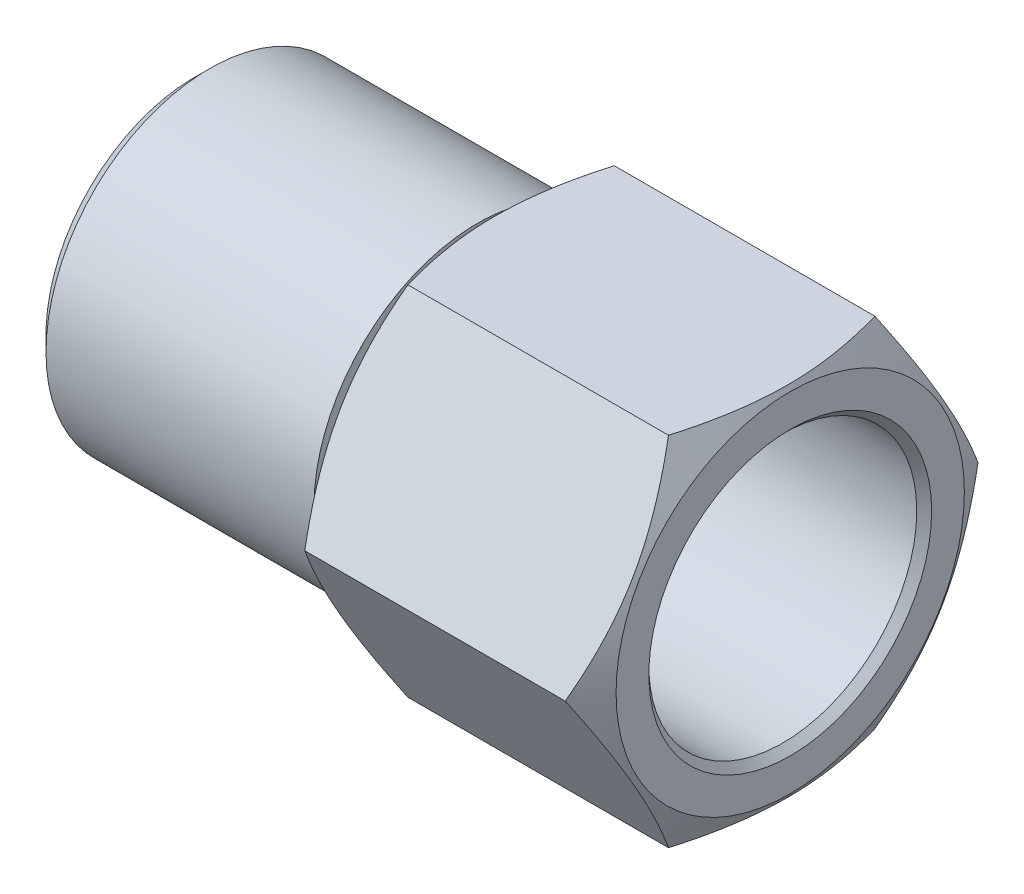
ISO-10303-21;
HEADER;
FILE_DESCRIPTION(('STEP AP214'),'2;1');
FILE_NAME('part.step','',(''),(''),'','','');
FILE_SCHEMA(('AUTOMOTIVE_DESIGN { 1 0 10303 214 1 1 1 1 }'));
ENDSEC;
DATA;
#1=APPLICATION_CONTEXT('core data for automotive mechanical design processes');
#2=APPLICATION_PROTOCOL_DEFINITION('international standard','automotive_design',2000,#1);
#3=PRODUCT_CONTEXT('',#1,'mechanical');
#4=PRODUCT('Part','Part','',(#3));
#5=PRODUCT_RELATED_PRODUCT_CATEGORY('part','',(#4));
#6=PRODUCT_DEFINITION_FORMATION('','',#4);
#7=PRODUCT_DEFINITION_CONTEXT('part definition',#1,'design');
#8=PRODUCT_DEFINITION('design','',#6,#7);
#9=PRODUCT_DEFINITION_SHAPE('','',#8);
#10=(LENGTH_UNIT() NAMED_UNIT(*) SI_UNIT(.MILLI.,.METRE.));
#11=(NAMED_UNIT(*) PLANE_ANGLE_UNIT() SI_UNIT($,.RADIAN.));
#12=(NAMED_UNIT(*) SI_UNIT($,.STERADIAN.) SOLID_ANGLE_UNIT());
#13=UNCERTAINTY_MEASURE_WITH_UNIT(LENGTH_MEASURE(1.E-05),#10,'distance_accuracy_value','');
#14=(GEOMETRIC_REPRESENTATION_CONTEXT(3) GLOBAL_UNCERTAINTY_ASSIGNED_CONTEXT((#13)) GLOBAL_UNIT_ASSIGNED_CONTEXT((#10,
#11,#12)) REPRESENTATION_CONTEXT('',''));
#15=CARTESIAN_POINT('',(0.,0.,0.));
#16=DIRECTION('',(0.,0.,1.));
#17=DIRECTION('',(1.,0.,0.));
#18=AXIS2_PLACEMENT_3D('',#15,#16,#17);
#19=CARTESIAN_POINT('',(-20.,0.,0.));
#20=DIRECTION('',(1.,0.,0.));
#21=DIRECTION('',(0.,0.,-1.));
#22=AXIS2_PLACEMENT_3D('',#19,#20,#21);
#23=CYLINDRICAL_SURFACE('',#22,10.);
#24=CARTESIAN_POINT('',(-1.,0.,0.));
#25=DIRECTION('',(1.,0.,0.));
#26=DIRECTION('',(0.,0.,-1.));
#27=AXIS2_PLACEMENT_3D('',#24,#25,#26);
#28=CIRCLE('',#27,10.);
#29=CARTESIAN_POINT('',(-1.,0.,-10.));
#30=VERTEX_POINT('',#29);
#31=EDGE_CURVE('P0_E15',#30,#30,#28,.F.);
#32=ORIENTED_EDGE('',*,*,#31,.T.);
#33=EDGE_LOOP('',(#32));
#34=FACE_BOUND('',#33,.T.);
#35=CARTESIAN_POINT('',(-20.,0.,0.));
#36=DIRECTION('',(1.,0.,0.));
#37=DIRECTION('',(0.,0.,-1.));
#38=AXIS2_PLACEMENT_3D('',#35,#36,#37);
#39=CIRCLE('',#38,10.);
#40=CARTESIAN_POINT('',(-20.,0.,-10.));
#41=VERTEX_POINT('',#40);
#42=EDGE_CURVE('P0_E10',#41,#41,#39,.T.);
#43=ORIENTED_EDGE('',*,*,#42,.T.);
#44=EDGE_LOOP('',(#43));
#45=FACE_BOUND('',#44,.T.);
#46=ADVANCED_FACE('P0_F14',(#34,#45),#23,.T.);
#47=OPEN_SHELL('',(#46));
#48=SHELL_BASED_SURFACE_MODEL('P0_B1',(#47));
#49=CARTESIAN_POINT('',(20.,0.,0.));
#50=DIRECTION('',(-1.,0.,0.));
#51=DIRECTION('',(0.,0.,1.));
#52=AXIS2_PLACEMENT_3D('',#49,#50,#51);
#53=CYLINDRICAL_SURFACE('',#52,10.);
#54=CARTESIAN_POINT('',(5.,0.,0.));
#55=DIRECTION('',(-1.,0.,0.));
#56=DIRECTION('',(0.,0.,1.));
#57=AXIS2_PLACEMENT_3D('',#54,#55,#56);
#58=CIRCLE('',#57,10.);
#59=CARTESIAN_POINT('',(5.,0.,10.));
#60=VERTEX_POINT('',#59);
#61=EDGE_CURVE('P1_E15',#60,#60,#58,.F.);
#62=ORIENTED_EDGE('',*,*,#61,.T.);
#63=EDGE_LOOP('',(#62));
#64=FACE_BOUND('',#63,.T.);
#65=CARTESIAN_POINT('',(20.,0.,0.));
#66=DIRECTION('',(-1.,0.,0.));
#67=DIRECTION('',(0.,0.,1.));
#68=AXIS2_PLACEMENT_3D('',#65,#66,#67);
#69=CIRCLE('',#68,10.);
#70=CARTESIAN_POINT('',(20.,0.,10.));
#71=VERTEX_POINT('',#70);
#72=EDGE_CURVE('P1_E10',#71,#71,#69,.T.);
#73=ORIENTED_EDGE('',*,*,#72,.T.);
#74=EDGE_LOOP('',(#73));
#75=FACE_BOUND('',#74,.T.);
#76=ADVANCED_FACE('P1_F14',(#64,#75),#53,.T.);
#77=OPEN_SHELL('',(#76));
#78=SHELL_BASED_SURFACE_MODEL('P1_B1',(#77));
#79=CARTESIAN_POINT('',(20.,0.,0.));
#80=DIRECTION('',(1.,0.,0.));
#81=DIRECTION('',(0.,0.,-1.));
#82=AXIS2_PLACEMENT_3D('',#79,#80,#81);
#83=CONICAL_SURFACE('',#82,9.5,0.785398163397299);
#84=CARTESIAN_POINT('',(19.5,0.,0.));
#85=DIRECTION('',(1.,0.,0.));
#86=DIRECTION('',(0.,0.,-1.));
#87=AXIS2_PLACEMENT_3D('',#84,#85,#86);
#88=CIRCLE('',#87,9.);
#89=CARTESIAN_POINT('',(19.5,0.,-9.));
#90=VERTEX_POINT('',#89);
#91=EDGE_CURVE('P2_E210',#90,#90,#88,.F.);
#92=ORIENTED_EDGE('',*,*,#91,.T.);
#93=EDGE_LOOP('',(#92));
#94=FACE_BOUND('',#93,.T.);
#95=CARTESIAN_POINT('',(20.,0.,0.));
#96=DIRECTION('',(1.,0.,0.));
#97=DIRECTION('',(0.,0.,-1.));
#98=AXIS2_PLACEMENT_3D('',#95,#96,#97);
#99=CIRCLE('',#98,9.5);
#100=CARTESIAN_POINT('',(20.,0.,-9.5));
#101=VERTEX_POINT('',#100);
#102=EDGE_CURVE('P2_E19',#101,#101,#99,.F.);
#103=ORIENTED_EDGE('',*,*,#102,.F.);
#104=EDGE_LOOP('',(#103));
#105=FACE_BOUND('',#104,.T.);
#106=ADVANCED_FACE('P2_F16',(#94,#105),#83,.F.);
#107=CARTESIAN_POINT('',(20.,0.,0.));
#108=DIRECTION('',(1.,0.,0.));
#109=DIRECTION('',(0.,0.,-1.));
#110=AXIS2_PLACEMENT_3D('',#107,#108,#109);
#111=CYLINDRICAL_SURFACE('',#110,9.);
#112=CARTESIAN_POINT('',(5.,0.,0.));
#113=DIRECTION('',(1.,0.,0.));
#114=DIRECTION('',(0.,0.,-1.));
#115=AXIS2_PLACEMENT_3D('',#112,#113,#114);
#116=CIRCLE('',#115,9.);
#117=CARTESIAN_POINT('',(5.,0.,-9.));
#118=VERTEX_POINT('',#117);
#119=EDGE_CURVE('P2_E418',#118,#118,#116,.T.);
#120=ORIENTED_EDGE('',*,*,#119,.F.);
#121=EDGE_LOOP('',(#120));
#122=FACE_BOUND('',#121,.T.);
#123=ORIENTED_EDGE('',*,*,#91,.F.);
#124=EDGE_LOOP('',(#123));
#125=FACE_BOUND('',#124,.T.);
#126=ADVANCED_FACE('P2_F392',(#122,#125),#111,.F.);
#127=CARTESIAN_POINT('',(20.,0.,0.));
#128=DIRECTION('',(1.,0.,0.));
#129=DIRECTION('',(0.,0.,-1.));
#130=AXIS2_PLACEMENT_3D('',#127,#128,#129);
#131=PLANE('',#130);
#132=ORIENTED_EDGE('',*,*,#102,.T.);
#133=EDGE_LOOP('',(#132));
#134=FACE_BOUND('',#133,.T.);
#135=CARTESIAN_POINT('',(19.9999999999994,0.,0.));
#136=DIRECTION('',(-1.,0.,0.));
#137=DIRECTION('',(0.,-1.,0.));
#138=AXIS2_PLACEMENT_3D('',#135,#136,#137);
#139=CIRCLE('',#138,11.6999999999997);
#140=CARTESIAN_POINT('',(19.9999999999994,-11.6999999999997,0.));
#141=VERTEX_POINT('',#140);
#142=EDGE_CURVE('P2_E420',#141,#141,#139,.T.);
#143=ORIENTED_EDGE('',*,*,#142,.F.);
#144=EDGE_LOOP('',(#143));
#145=FACE_BOUND('',#144,.T.);
#146=ADVANCED_FACE('P2_F383',(#134,#145),#131,.T.);
#147=CARTESIAN_POINT('',(5.,0.,0.));
#148=DIRECTION('',(1.,0.,0.));
#149=DIRECTION('',(0.,0.,-1.));
#150=AXIS2_PLACEMENT_3D('',#147,#148,#149);
#151=PLANE('',#150);
#152=CARTESIAN_POINT('',(5.,0.,0.));
#153=DIRECTION('',(1.,0.,0.));
#154=DIRECTION('',(0.,0.,-1.));
#155=AXIS2_PLACEMENT_3D('',#152,#153,#154);
#156=CIRCLE('',#155,4.);
#157=CARTESIAN_POINT('',(5.,0.,-4.));
#158=VERTEX_POINT('',#157);
#159=EDGE_CURVE('P2_E73',#158,#158,#156,.F.);
#160=ORIENTED_EDGE('',*,*,#159,.T.);
#161=EDGE_LOOP('',(#160));
#162=FACE_BOUND('',#161,.T.);
#163=ORIENTED_EDGE('',*,*,#119,.T.);
#164=EDGE_LOOP('',(#163));
#165=FACE_BOUND('',#164,.T.);
#166=ADVANCED_FACE('P2_F110',(#162,#165),#151,.T.);
#167=CARTESIAN_POINT('',(18.7423118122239,0.,0.));
#168=DIRECTION('',(-1.,0.,0.));
#169=DIRECTION('',(0.,-1.,0.));
#170=AXIS2_PLACEMENT_3D('',#167,#168,#169);
#171=CONICAL_SURFACE('',#170,13.8783798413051,1.0471975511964);
#172=CARTESIAN_POINT('',(18.7498129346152,-1.29816990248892E-12,-13.8653875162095));
#173=CARTESIAN_POINT('',(18.8378432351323,-0.263868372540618,-13.7128850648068));
#174=CARTESIAN_POINT('',(18.9218838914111,-0.528720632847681,-13.5598139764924));
#175=CARTESIAN_POINT('',(19.0808780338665,-1.06054969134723,-13.2524439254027));
#176=CARTESIAN_POINT('',(19.1558285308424,-1.32752715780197,-13.0981445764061));
#177=CARTESIAN_POINT('',(19.3655965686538,-2.13276584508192,-12.6327577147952));
#178=CARTESIAN_POINT('',(19.4849450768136,-2.67420755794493,-12.3198320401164));
#179=CARTESIAN_POINT('',(19.6249532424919,-3.48445630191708,-11.8515496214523));
#180=CARTESIAN_POINT('',(19.6648485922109,-3.75083874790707,-11.6975941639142));
#181=CARTESIAN_POINT('',(19.731779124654,-4.28483994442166,-11.3889687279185));
#182=CARTESIAN_POINT('',(19.7588140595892,-4.55245871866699,-11.2342987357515));
#183=CARTESIAN_POINT('',(19.7993312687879,-5.08814532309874,-10.9246992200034));
#184=CARTESIAN_POINT('',(19.8128296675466,-5.35621223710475,-10.7697702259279));
#185=CARTESIAN_POINT('',(19.8259858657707,-5.89259773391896,-10.4597667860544));
#186=CARTESIAN_POINT('',(19.8256440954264,-6.16091630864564,-10.3046923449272));
#187=CARTESIAN_POINT('',(19.8120786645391,-6.66233855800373,-10.0148958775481));
#188=CARTESIAN_POINT('',(19.8005383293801,-6.89547783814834,-9.88015327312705));
#189=CARTESIAN_POINT('',(19.767224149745,-7.36122287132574,-9.61097641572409));
#190=CARTESIAN_POINT('',(19.7454495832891,-7.5938285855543,-9.4765421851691));
#191=CARTESIAN_POINT('',(19.6920462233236,-8.0583798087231,-9.20805528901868));
#192=CARTESIAN_POINT('',(19.6604093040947,-8.29032461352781,-9.07400303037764));
#193=CARTESIAN_POINT('',(19.587835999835,-8.75312937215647,-8.80652550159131));
#194=CARTESIAN_POINT('',(19.5468989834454,-8.98398925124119,-8.67310027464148));
#195=CARTESIAN_POINT('',(19.409103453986,-9.684773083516,-8.26808298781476));
#196=CARTESIAN_POINT('',(19.2984799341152,-10.152671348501,-7.99766167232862));
#197=CARTESIAN_POINT('',(19.0473538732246,-11.0814989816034,-7.4608467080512));
#198=CARTESIAN_POINT('',(18.9069102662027,-11.5424402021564,-7.19444620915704));
#199=CARTESIAN_POINT('',(18.7544794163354,-11.9999999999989,-6.93000000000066));
#200=B_SPLINE_CURVE_WITH_KNOTS('',3,(#172,#173,#174,#175,#176,#177,#178,#179,#180,#181,#182,
#183,#184,#185,#186,#187,#188,#189,#190,#191,#192,#193,#194,#195,#196,#197,#198,#199),
.UNSPECIFIED.,.F.,.F.,(4,2,2,2,2,2,2,2,2,2,2,2,2,4),(0.,0.951604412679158,1.90352090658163,
3.81141614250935,4.74194225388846,5.67248629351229,6.60192056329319,7.53132594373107,
8.33970056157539,9.14813221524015,9.95723171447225,10.7663861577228,12.4202515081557,
14.0708782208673),.UNSPECIFIED.);
#201=CARTESIAN_POINT('',(18.7498129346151,-6.4928565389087E-13,-13.8653875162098));
#202=VERTEX_POINT('',#201);
#203=CARTESIAN_POINT('',(18.7544794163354,-11.9999999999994,-6.92999999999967));
#204=VERTEX_POINT('',#203);
#205=EDGE_CURVE('P2_E62',#202,#204,#200,.T.);
#206=ORIENTED_EDGE('',*,*,#205,.F.);
#207=CARTESIAN_POINT('',(18.7544794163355,11.9999999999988,-6.93000000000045));
#208=CARTESIAN_POINT('',(18.8423175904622,11.7362751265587,-7.08241951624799));
#209=CARTESIAN_POINT('',(18.9261621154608,11.47152162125,-7.23543352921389));
#210=CARTESIAN_POINT('',(19.0847550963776,10.939892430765,-7.54268806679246));
#211=CARTESIAN_POINT('',(19.1595005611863,10.6730160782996,-7.69692897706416));
#212=CARTESIAN_POINT('',(19.2988889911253,10.1366280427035,-8.00693388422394));
#213=CARTESIAN_POINT('',(19.3635081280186,9.86711168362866,-8.16270058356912));
#214=CARTESIAN_POINT('',(19.4812559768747,9.326208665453,-8.47531492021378));
#215=CARTESIAN_POINT('',(19.5343853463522,9.05482211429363,-8.63216249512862));
#216=CARTESIAN_POINT('',(19.626894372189,8.51712969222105,-8.94292127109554));
#217=CARTESIAN_POINT('',(19.6665808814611,8.25086363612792,-9.09680946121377));
#218=CARTESIAN_POINT('',(19.7330883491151,7.71711531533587,-9.40528874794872));
#219=CARTESIAN_POINT('',(19.7599090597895,7.4496330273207,-9.55987985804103));
#220=CARTESIAN_POINT('',(19.800007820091,6.91422282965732,-9.86931962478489));
#221=CARTESIAN_POINT('',(19.8133019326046,6.64629582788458,-10.0241677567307));
#222=CARTESIAN_POINT('',(19.8260619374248,6.11019884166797,-10.3340044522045));
#223=CARTESIAN_POINT('',(19.8255282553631,5.84202886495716,-10.488993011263));
#224=CARTESIAN_POINT('',(19.8116131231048,5.34061248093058,-10.7787860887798));
#225=CARTESIAN_POINT('',(19.7999003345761,5.10732994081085,-10.9136114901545));
#226=CARTESIAN_POINT('',(19.7662332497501,4.64130433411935,-11.182950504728));
#227=CARTESIAN_POINT('',(19.7442782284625,4.4085613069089,-11.317464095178));
#228=CARTESIAN_POINT('',(19.6905093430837,3.94374079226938,-11.5861066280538));
#229=CARTESIAN_POINT('',(19.6586873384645,3.71166401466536,-11.7202351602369));
#230=CARTESIAN_POINT('',(19.5857424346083,3.24860045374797,-11.9878622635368));
#231=CARTESIAN_POINT('',(19.5446189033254,3.01761374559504,-12.1213607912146));
#232=CARTESIAN_POINT('',(19.4062565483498,2.3164437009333,-12.5266012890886));
#233=CARTESIAN_POINT('',(19.2952545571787,1.8482931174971,-12.7971684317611));
#234=CARTESIAN_POINT('',(19.043390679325,0.91897523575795,-13.3342667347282));
#235=CARTESIAN_POINT('',(18.9025878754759,0.457796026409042,-13.6008047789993));
#236=CARTESIAN_POINT('',(18.7498129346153,1.10684295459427E-12,-13.8653875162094));
#237=B_SPLINE_CURVE_WITH_KNOTS('',3,(#207,#208,#209,#210,#211,#212,#213,#214,#215,#216,#217,
#218,#219,#220,#221,#222,#223,#224,#225,#226,#227,#228,#229,#230,#231,#232,#233,#234,#235,#236),
.UNSPECIFIED.,.F.,.F.,(4,2,2,2,2,2,2,2,2,2,2,2,2,2,4),(0.,0.951067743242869,1.90244728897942,
2.85603295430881,3.80956403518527,4.73957300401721,5.6695998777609,6.59852104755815,
7.52741362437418,8.33630605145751,9.14525574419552,9.95487462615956,10.7645485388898,
12.4194997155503,14.0712000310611),.UNSPECIFIED.);
#238=CARTESIAN_POINT('',(18.7544794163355,11.9999999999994,-6.92999999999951));
#239=VERTEX_POINT('',#238);
#240=EDGE_CURVE('P2_E67',#239,#202,#237,.T.);
#241=ORIENTED_EDGE('',*,*,#240,.F.);
#242=CARTESIAN_POINT('',(18.7544794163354,12.,6.92999999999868));
#243=CARTESIAN_POINT('',(18.8424119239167,12.,6.62539321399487));
#244=CARTESIAN_POINT('',(18.9263547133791,12.,6.3196506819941));
#245=CARTESIAN_POINT('',(19.0851536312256,12.,5.70571362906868));
#246=CARTESIAN_POINT('',(19.1600067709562,12.,5.39751833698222));
#247=CARTESIAN_POINT('',(19.3694836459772,12.,4.46796520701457));
#248=CARTESIAN_POINT('',(19.488640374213,12.,3.84293738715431));
#249=CARTESIAN_POINT('',(19.6283757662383,12.,2.90761162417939));
#250=CARTESIAN_POINT('',(19.6681837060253,12.,2.60010901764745));
#251=CARTESIAN_POINT('',(19.734945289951,12.,1.98367929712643));
#252=CARTESIAN_POINT('',(19.7618986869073,12.,1.67475215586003));
#253=CARTESIAN_POINT('',(19.8022607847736,12.,1.05638215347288));
#254=CARTESIAN_POINT('',(19.815685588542,12.,0.746940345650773));
#255=CARTESIAN_POINT('',(19.8287043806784,12.,0.127769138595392));
#256=CARTESIAN_POINT('',(19.8282987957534,12.,-0.181960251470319));
#257=CARTESIAN_POINT('',(19.8146167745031,12.,-0.761102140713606));
#258=CARTESIAN_POINT('',(19.8030092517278,12.,-1.03055573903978));
#259=CARTESIAN_POINT('',(19.7695449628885,12.,-1.56884333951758));
#260=CARTESIAN_POINT('',(19.7476874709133,12.,-1.83767729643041));
#261=CARTESIAN_POINT('',(19.6941046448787,12.,-2.37457944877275));
#262=CARTESIAN_POINT('',(19.6623711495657,12.,-2.64264682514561));
#263=CARTESIAN_POINT('',(19.5895935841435,12.,-3.17752433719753));
#264=CARTESIAN_POINT('',(19.5485488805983,12.,-3.44433438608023));
#265=CARTESIAN_POINT('',(19.4104099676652,12.,-4.25425715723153));
#266=CARTESIAN_POINT('',(19.2995362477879,12.,-4.79502329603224));
#267=CARTESIAN_POINT('',(19.0478914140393,12.,-5.86848746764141));
#268=CARTESIAN_POINT('',(18.9071794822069,12.,-6.40119926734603));
#269=CARTESIAN_POINT('',(18.7544794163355,12.,-6.92999999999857));
#270=B_SPLINE_CURVE_WITH_KNOTS('',3,(#242,#243,#244,#245,#246,#247,#248,#249,#250,#251,#252,
#253,#254,#255,#256,#257,#258,#259,#260,#261,#262,#263,#264,#265,#266,#267,#268,#269),
.UNSPECIFIED.,.F.,.F.,(4,2,2,2,2,2,2,2,2,2,2,2,2,4),(0.,0.951058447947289,1.90242875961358,
3.80922199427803,4.73921134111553,5.66921857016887,6.59811751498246,7.52698780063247,
8.33590321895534,9.14487593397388,9.95451894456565,10.7642170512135,12.419241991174,
14.0710145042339),.UNSPECIFIED.);
#271=CARTESIAN_POINT('',(18.7544794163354,11.9999999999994,6.92999999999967));
#272=VERTEX_POINT('',#271);
#273=EDGE_CURVE('P2_E81',#272,#239,#270,.T.);
#274=ORIENTED_EDGE('',*,*,#273,.F.);
#275=CARTESIAN_POINT('',(18.7498129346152,1.30004469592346E-12,13.8653875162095));
#276=CARTESIAN_POINT('',(18.8378432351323,0.263868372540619,13.7128850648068));
#277=CARTESIAN_POINT('',(18.9218838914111,0.528720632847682,13.5598139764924));
#278=CARTESIAN_POINT('',(19.0808780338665,1.06054969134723,13.2524439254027));
#279=CARTESIAN_POINT('',(19.1558285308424,1.32752715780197,13.0981445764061));
#280=CARTESIAN_POINT('',(19.3655965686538,2.13276584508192,12.6327577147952));
#281=CARTESIAN_POINT('',(19.4849450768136,2.67420755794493,12.3198320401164));
#282=CARTESIAN_POINT('',(19.6249532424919,3.48445630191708,11.8515496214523));
#283=CARTESIAN_POINT('',(19.6648485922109,3.75083874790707,11.6975941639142));
#284=CARTESIAN_POINT('',(19.731779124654,4.28483994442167,11.3889687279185));
#285=CARTESIAN_POINT('',(19.7588140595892,4.55245871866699,11.2342987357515));
#286=CARTESIAN_POINT('',(19.7993312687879,5.08814532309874,10.9246992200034));
#287=CARTESIAN_POINT('',(19.8128296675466,5.35621223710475,10.7697702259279));
#288=CARTESIAN_POINT('',(19.8259858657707,5.89259773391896,10.4597667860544));
#289=CARTESIAN_POINT('',(19.8256440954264,6.16091630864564,10.3046923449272));
#290=CARTESIAN_POINT('',(19.8120786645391,6.66233855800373,10.0148958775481));
#291=CARTESIAN_POINT('',(19.8005383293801,6.89547783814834,9.88015327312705));
#292=CARTESIAN_POINT('',(19.767224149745,7.36122287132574,9.61097641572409));
#293=CARTESIAN_POINT('',(19.7454495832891,7.5938285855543,9.4765421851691));
#294=CARTESIAN_POINT('',(19.6920462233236,8.0583798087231,9.20805528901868));
#295=CARTESIAN_POINT('',(19.6604093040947,8.29032461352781,9.07400303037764));
#296=CARTESIAN_POINT('',(19.587835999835,8.75312937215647,8.80652550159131));
#297=CARTESIAN_POINT('',(19.5468989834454,8.98398925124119,8.67310027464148));
#298=CARTESIAN_POINT('',(19.409103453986,9.684773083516,8.26808298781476));
#299=CARTESIAN_POINT('',(19.2984799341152,10.152671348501,7.99766167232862));
#300=CARTESIAN_POINT('',(19.0473538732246,11.0814989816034,7.4608467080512));
#301=CARTESIAN_POINT('',(18.9069102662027,11.5424402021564,7.19444620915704));
#302=CARTESIAN_POINT('',(18.7544794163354,11.9999999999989,6.93000000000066));
#303=B_SPLINE_CURVE_WITH_KNOTS('',3,(#275,#276,#277,#278,#279,#280,#281,#282,#283,#284,#285,
#286,#287,#288,#289,#290,#291,#292,#293,#294,#295,#296,#297,#298,#299,#300,#301,#302),
.UNSPECIFIED.,.F.,.F.,(4,2,2,2,2,2,2,2,2,2,2,2,2,4),(0.,0.951604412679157,1.90352090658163,
3.81141614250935,4.74194225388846,5.67248629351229,6.60192056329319,7.53132594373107,
8.33970056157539,9.14813221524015,9.95723171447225,10.7663861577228,12.4202515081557,
14.0708782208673),.UNSPECIFIED.);
#304=CARTESIAN_POINT('',(18.7498129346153,1.1004508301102E-13,13.8653875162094));
#305=VERTEX_POINT('',#304);
#306=EDGE_CURVE('P2_E115',#305,#272,#303,.T.);
#307=ORIENTED_EDGE('',*,*,#306,.F.);
#308=CARTESIAN_POINT('',(18.7544794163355,-11.9999999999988,6.93000000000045));
#309=CARTESIAN_POINT('',(18.8423175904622,-11.7362751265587,7.082419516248));
#310=CARTESIAN_POINT('',(18.9261621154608,-11.47152162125,7.2354335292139));
#311=CARTESIAN_POINT('',(19.0847550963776,-10.939892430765,7.54268806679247));
#312=CARTESIAN_POINT('',(19.1595005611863,-10.6730160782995,7.69692897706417));
#313=CARTESIAN_POINT('',(19.2988889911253,-10.1366280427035,8.00693388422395));
#314=CARTESIAN_POINT('',(19.3635081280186,-9.86711168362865,8.16270058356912));
#315=CARTESIAN_POINT('',(19.4812559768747,-9.32620866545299,8.47531492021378));
#316=CARTESIAN_POINT('',(19.5343853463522,-9.05482211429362,8.63216249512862));
#317=CARTESIAN_POINT('',(19.626894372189,-8.51712969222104,8.94292127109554));
#318=CARTESIAN_POINT('',(19.6665808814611,-8.25086363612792,9.09680946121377));
#319=CARTESIAN_POINT('',(19.7330883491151,-7.71711531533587,9.40528874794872));
#320=CARTESIAN_POINT('',(19.7599090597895,-7.44963302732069,9.55987985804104));
#321=CARTESIAN_POINT('',(19.800007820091,-6.91422282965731,9.86931962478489));
#322=CARTESIAN_POINT('',(19.8133019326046,-6.64629582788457,10.0241677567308));
#323=CARTESIAN_POINT('',(19.8260619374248,-6.11019884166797,10.3340044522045));
#324=CARTESIAN_POINT('',(19.8255282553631,-5.84202886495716,10.488993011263));
#325=CARTESIAN_POINT('',(19.8116131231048,-5.34061248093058,10.7787860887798));
#326=CARTESIAN_POINT('',(19.7999003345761,-5.10732994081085,10.9136114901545));
#327=CARTESIAN_POINT('',(19.7662332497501,-4.64130433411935,11.182950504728));
#328=CARTESIAN_POINT('',(19.7442782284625,-4.40856130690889,11.317464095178));
#329=CARTESIAN_POINT('',(19.6905093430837,-3.94374079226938,11.5861066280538));
#330=CARTESIAN_POINT('',(19.6586873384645,-3.71166401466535,11.7202351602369));
#331=CARTESIAN_POINT('',(19.5857424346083,-3.24860045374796,11.9878622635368));
#332=CARTESIAN_POINT('',(19.5446189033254,-3.01761374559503,12.1213607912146));
#333=CARTESIAN_POINT('',(19.4062565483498,-2.31644370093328,12.5266012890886));
#334=CARTESIAN_POINT('',(19.2952545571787,-1.84829311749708,12.7971684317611));
#335=CARTESIAN_POINT('',(19.043390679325,-0.91897523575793,13.3342667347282));
#336=CARTESIAN_POINT('',(18.9025878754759,-0.45779602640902,13.6008047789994));
#337=CARTESIAN_POINT('',(18.7498129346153,-1.08127434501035E-12,13.8653875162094));
#338=B_SPLINE_CURVE_WITH_KNOTS('',3,(#308,#309,#310,#311,#312,#313,#314,#315,#316,#317,#318,
#319,#320,#321,#322,#323,#324,#325,#326,#327,#328,#329,#330,#331,#332,#333,#334,#335,#336,#337),
.UNSPECIFIED.,.F.,.F.,(4,2,2,2,2,2,2,2,2,2,2,2,2,2,4),(0.,0.951067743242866,1.90244728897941,
2.8560329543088,3.80956403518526,4.7395730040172,5.66959987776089,6.59852104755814,
7.52741362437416,8.33630605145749,9.14525574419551,9.95487462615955,10.7645485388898,
12.4194997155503,14.0712000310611),.UNSPECIFIED.);
#339=CARTESIAN_POINT('',(18.7544794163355,-11.9999999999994,6.92999999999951));
#340=VERTEX_POINT('',#339);
#341=EDGE_CURVE('P2_E124',#340,#305,#338,.T.);
#342=ORIENTED_EDGE('',*,*,#341,.F.);
#343=CARTESIAN_POINT('',(18.7544794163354,-12.,-6.92999999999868));
#344=CARTESIAN_POINT('',(18.8424119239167,-12.,-6.62539321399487));
#345=CARTESIAN_POINT('',(18.9263547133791,-12.,-6.3196506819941));
#346=CARTESIAN_POINT('',(19.0851536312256,-12.,-5.70571362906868));
#347=CARTESIAN_POINT('',(19.1600067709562,-12.,-5.39751833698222));
#348=CARTESIAN_POINT('',(19.3694836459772,-12.,-4.46796520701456));
#349=CARTESIAN_POINT('',(19.488640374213,-12.,-3.8429373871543));
#350=CARTESIAN_POINT('',(19.6283757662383,-12.,-2.90761162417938));
#351=CARTESIAN_POINT('',(19.6681837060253,-12.,-2.60010901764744));
#352=CARTESIAN_POINT('',(19.734945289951,-12.,-1.98367929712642));
#353=CARTESIAN_POINT('',(19.7618986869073,-12.,-1.67475215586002));
#354=CARTESIAN_POINT('',(19.8022607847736,-12.,-1.05638215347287));
#355=CARTESIAN_POINT('',(19.815685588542,-12.,-0.74694034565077));
#356=CARTESIAN_POINT('',(19.8287043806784,-12.,-0.12776913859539));
#357=CARTESIAN_POINT('',(19.8282987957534,-12.,0.181960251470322));
#358=CARTESIAN_POINT('',(19.8146167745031,-12.,0.761102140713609));
#359=CARTESIAN_POINT('',(19.8030092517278,-12.,1.03055573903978));
#360=CARTESIAN_POINT('',(19.7695449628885,-12.,1.56884333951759));
#361=CARTESIAN_POINT('',(19.7476874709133,-12.,1.83767729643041));
#362=CARTESIAN_POINT('',(19.6941046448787,-12.,2.37457944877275));
#363=CARTESIAN_POINT('',(19.6623711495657,-12.,2.64264682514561));
#364=CARTESIAN_POINT('',(19.5895935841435,-12.,3.17752433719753));
#365=CARTESIAN_POINT('',(19.5485488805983,-12.,3.44433438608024));
#366=CARTESIAN_POINT('',(19.4104099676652,-12.,4.25425715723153));
#367=CARTESIAN_POINT('',(19.2995362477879,-12.,4.79502329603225));
#368=CARTESIAN_POINT('',(19.0478914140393,-12.,5.86848746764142));
#369=CARTESIAN_POINT('',(18.9071794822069,-12.,6.40119926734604));
#370=CARTESIAN_POINT('',(18.7544794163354,-12.,6.92999999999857));
#371=B_SPLINE_CURVE_WITH_KNOTS('',3,(#343,#344,#345,#346,#347,#348,#349,#350,#351,#352,#353,
#354,#355,#356,#357,#358,#359,#360,#361,#362,#363,#364,#365,#366,#367,#368,#369,#370),
.UNSPECIFIED.,.F.,.F.,(4,2,2,2,2,2,2,2,2,2,2,2,2,4),(0.,0.951058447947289,1.90242875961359,
3.80922199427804,4.73921134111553,5.66921857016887,6.59811751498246,7.52698780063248,
8.33590321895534,9.14487593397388,9.95451894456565,10.7642170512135,12.419241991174,
14.0710145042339),.UNSPECIFIED.);
#372=EDGE_CURVE('P2_E70',#204,#340,#371,.T.);
#373=ORIENTED_EDGE('',*,*,#372,.F.);
#374=EDGE_LOOP('',(#206,#241,#274,#307,#342,#373));
#375=FACE_BOUND('',#374,.T.);
#376=ORIENTED_EDGE('',*,*,#142,.T.);
#377=EDGE_LOOP('',(#376));
#378=FACE_BOUND('',#377,.T.);
#379=ADVANCED_FACE('P2_F63',(#375,#378),#171,.T.);
#380=CARTESIAN_POINT('',(0.,0.,0.));
#381=DIRECTION('',(1.,0.,0.));
#382=DIRECTION('',(0.,0.,-1.));
#383=AXIS2_PLACEMENT_3D('',#380,#381,#382);
#384=CYLINDRICAL_SURFACE('',#383,4.);
#385=CARTESIAN_POINT('',(0.,0.,0.));
#386=DIRECTION('',(1.,0.,0.));
#387=DIRECTION('',(0.,0.,-1.));
#388=AXIS2_PLACEMENT_3D('',#385,#386,#387);
#389=CIRCLE('',#388,4.);
#390=CARTESIAN_POINT('',(0.,0.,-4.));
#391=VERTEX_POINT('',#390);
#392=EDGE_CURVE('P2_E84',#391,#391,#389,.F.);
#393=ORIENTED_EDGE('',*,*,#392,.T.);
#394=EDGE_LOOP('',(#393));
#395=FACE_BOUND('',#394,.T.);
#396=ORIENTED_EDGE('',*,*,#159,.F.);
#397=EDGE_LOOP('',(#396));
#398=FACE_BOUND('',#397,.T.);
#399=ADVANCED_FACE('P2_F109',(#395,#398),#384,.F.);
#400=CARTESIAN_POINT('',(0.,-12.,-6.93));
#401=DIRECTION('',(0.,-0.500388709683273,-0.865800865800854));
#402=DIRECTION('',(0.,0.865800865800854,-0.500388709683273));
#403=AXIS2_PLACEMENT_3D('',#400,#401,#402);
#404=PLANE('',#403);
#405=DIRECTION('',(1.,0.,0.));
#406=VECTOR('',#405,1.);
#407=CARTESIAN_POINT('',(0.,0.,-13.86538751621));
#408=LINE('',#407,#406);
#409=CARTESIAN_POINT('',(1.25018706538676,-3.96272927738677E-13,-13.8653875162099));
#410=VERTEX_POINT('',#409);
#411=EDGE_CURVE('P2_E75',#202,#410,#408,.F.);
#412=ORIENTED_EDGE('',*,*,#411,.F.);
#413=ORIENTED_EDGE('',*,*,#205,.T.);
#414=DIRECTION('',(1.,0.,0.));
#415=VECTOR('',#414,1.);
#416=CARTESIAN_POINT('',(0.,-12.,-6.93));
#417=LINE('',#416,#415);
#418=CARTESIAN_POINT('',(1.24552058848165,-12.,-6.93000001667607));
#419=VERTEX_POINT('',#418);
#420=EDGE_CURVE('P2_E72',#419,#204,#417,.T.);
#421=ORIENTED_EDGE('',*,*,#420,.F.);
#422=CARTESIAN_POINT('',(1.25018706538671,-7.92000152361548E-13,-13.8653875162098));
#423=CARTESIAN_POINT('',(1.1621567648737,-0.263868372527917,-13.7128850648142));
#424=CARTESIAN_POINT('',(1.07811610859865,-0.528720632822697,-13.5598139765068));
#425=CARTESIAN_POINT('',(0.919121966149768,-1.0605496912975,-13.2524439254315));
#426=CARTESIAN_POINT('',(0.844171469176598,-1.32752715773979,-13.098144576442));
#427=CARTESIAN_POINT('',(0.634403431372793,-2.13276584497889,-12.6327577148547));
#428=CARTESIAN_POINT('',(0.515054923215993,-2.67420755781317,-12.3198320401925));
#429=CARTESIAN_POINT('',(0.375046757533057,-3.48445630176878,-11.851549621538));
#430=CARTESIAN_POINT('',(0.335151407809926,-3.75083874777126,-11.6975941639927));
#431=CARTESIAN_POINT('',(0.26822087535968,-4.28483994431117,-11.3889687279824));
#432=CARTESIAN_POINT('',(0.24118594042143,-4.55245871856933,-11.2342987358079));
#433=CARTESIAN_POINT('',(0.200668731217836,-5.08814532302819,-10.9246992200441));
#434=CARTESIAN_POINT('',(0.187170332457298,-5.35621223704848,-10.7697702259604));
#435=CARTESIAN_POINT('',(0.174014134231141,-5.89259773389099,-10.4597667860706));
#436=CARTESIAN_POINT('',(0.174355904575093,-6.16091630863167,-10.3046923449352));
#437=CARTESIAN_POINT('',(0.187921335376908,-6.66233855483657,-10.0148958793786));
#438=CARTESIAN_POINT('',(0.199461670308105,-6.89547783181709,-9.88015327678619));
#439=CARTESIAN_POINT('',(0.232775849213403,-7.36122285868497,-9.61097642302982));
#440=CARTESIAN_POINT('',(0.254550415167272,-7.59382856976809,-9.47654219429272));
#441=CARTESIAN_POINT('',(0.307953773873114,-8.05837978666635,-9.20805530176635));
#442=CARTESIAN_POINT('',(0.33959069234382,-8.290324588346,-9.07400304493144));
#443=CARTESIAN_POINT('',(0.41216399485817,-8.75312934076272,-8.8065255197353));
#444=CARTESIAN_POINT('',(0.453101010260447,-8.98398921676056,-8.67310029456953));
#445=CARTESIAN_POINT('',(0.590896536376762,-9.68477303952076,-8.26808301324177));
#446=CARTESIAN_POINT('',(0.701520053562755,-10.152671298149,-7.99766170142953));
#447=CARTESIAN_POINT('',(0.952646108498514,-11.0814989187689,-7.4608467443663));
#448=CARTESIAN_POINT('',(1.09308971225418,-11.5424401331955,-7.19444624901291));
#449=CARTESIAN_POINT('',(1.24552055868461,-11.9999999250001,-6.9300000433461));
#450=B_SPLINE_CURVE_WITH_KNOTS('',3,(#422,#423,#424,#425,#426,#427,#428,#429,#430,#431,#432,
#433,#434,#435,#436,#437,#438,#439,#440,#441,#442,#443,#444,#445,#446,#447,#448,#449),
.UNSPECIFIED.,.F.,.F.,(4,2,2,2,2,2,2,2,2,2,2,2,2,4),(0.,0.951604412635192,1.90352090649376,
3.81141614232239,4.74194225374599,5.67248629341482,6.60192056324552,7.53132594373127,
8.33970055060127,9.14813219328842,9.9572316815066,10.766386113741,12.4202514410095,
14.0708781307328),.UNSPECIFIED.);
#451=EDGE_CURVE('P2_E34',#410,#419,#450,.T.);
#452=ORIENTED_EDGE('',*,*,#451,.F.);
#453=EDGE_LOOP('',(#412,#413,#421,#452));
#454=FACE_BOUND('',#453,.T.);
#455=ADVANCED_FACE('P2_F76',(#454),#404,.T.);
#456=CARTESIAN_POINT('',(0.,-12.,6.93));
#457=DIRECTION('',(0.,-1.,0.));
#458=DIRECTION('',(0.,0.,-1.));
#459=AXIS2_PLACEMENT_3D('',#456,#457,#458);
#460=PLANE('',#459);
#461=ORIENTED_EDGE('',*,*,#420,.T.);
#462=ORIENTED_EDGE('',*,*,#372,.T.);
#463=DIRECTION('',(1.,0.,0.));
#464=VECTOR('',#463,1.);
#465=CARTESIAN_POINT('',(0.,-12.,6.9299999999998));
#466=LINE('',#465,#464);
#467=CARTESIAN_POINT('',(1.24552058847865,-12.0000000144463,6.92999999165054));
#468=VERTEX_POINT('',#467);
#469=EDGE_CURVE('P2_E214',#468,#340,#466,.T.);
#470=ORIENTED_EDGE('',*,*,#469,.F.);
#471=CARTESIAN_POINT('',(1.2455206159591,-11.999999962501,-6.93000002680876));
#472=CARTESIAN_POINT('',(1.15758809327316,-11.9999999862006,-6.6253932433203));
#473=CARTESIAN_POINT('',(1.07364529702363,-11.9999999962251,-6.31965071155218));
#474=CARTESIAN_POINT('',(0.914846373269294,-12.0000000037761,-5.70571365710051));
#475=CARTESIAN_POINT('',(0.839993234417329,-12.0000000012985,-5.39751836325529));
#476=CARTESIAN_POINT('',(0.630516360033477,-11.9999999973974,-4.4679652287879));
#477=CARTESIAN_POINT('',(0.511359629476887,-11.9999999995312,-3.84293740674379));
#478=CARTESIAN_POINT('',(0.37162423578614,-12.0000000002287,-2.90761164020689));
#479=CARTESIAN_POINT('',(0.331816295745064,-12.0000000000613,-2.60010903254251));
#480=CARTESIAN_POINT('',(0.265054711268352,-11.9999999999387,-1.98367930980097));
#481=CARTESIAN_POINT('',(0.238101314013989,-11.9999999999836,-1.6747521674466));
#482=CARTESIAN_POINT('',(0.197739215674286,-12.0000000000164,-1.05638216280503));
#483=CARTESIAN_POINT('',(0.184314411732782,-12.0000000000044,-0.746940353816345));
#484=CARTESIAN_POINT('',(0.171295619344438,-11.9999999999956,-0.127769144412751));
#485=CARTESIAN_POINT('',(0.171701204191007,-11.9999999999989,0.181960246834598));
#486=CARTESIAN_POINT('',(0.185383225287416,-12.000000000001,0.761102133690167));
#487=CARTESIAN_POINT('',(0.19699074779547,-12.0000000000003,1.0305557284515));
#488=CARTESIAN_POINT('',(0.230455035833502,-11.9999999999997,1.56884332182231));
#489=CARTESIAN_POINT('',(0.252312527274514,-11.9999999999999,1.83767727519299));
#490=CARTESIAN_POINT('',(0.305895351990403,-12.0000000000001,2.37457942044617));
#491=CARTESIAN_POINT('',(0.337628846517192,-12.,2.64264679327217));
#492=CARTESIAN_POINT('',(0.410406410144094,-12.,3.17752429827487));
#493=CARTESIAN_POINT('',(0.451451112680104,-12.,3.44433434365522));
#494=CARTESIAN_POINT('',(0.589590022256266,-12.,4.25425710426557));
#495=CARTESIAN_POINT('',(0.700463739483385,-12.,4.7950232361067));
#496=CARTESIAN_POINT('',(0.952108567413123,-12.,5.86848739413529));
#497=CARTESIAN_POINT('',(1.09282049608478,-12.,6.40119918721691));
#498=CARTESIAN_POINT('',(1.24552055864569,-12.,6.9299999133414));
#499=B_SPLINE_CURVE_WITH_KNOTS('',3,(#471,#472,#473,#474,#475,#476,#477,#478,#479,#480,#481,
#482,#483,#484,#485,#486,#487,#488,#489,#490,#491,#492,#493,#494,#495,#496,#497,#498),
.UNSPECIFIED.,.F.,.F.,(4,2,2,2,2,2,2,2,2,2,2,2,2,4),(0.,0.951058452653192,1.90242876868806,
3.80922201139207,4.73921136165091,5.66921859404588,6.59811754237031,7.52698783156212,
8.33590323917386,9.14487594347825,9.95451894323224,10.76421703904,12.4192419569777,
14.0710144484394),.UNSPECIFIED.);
#500=EDGE_CURVE('P2_E154',#419,#468,#499,.T.);
#501=ORIENTED_EDGE('',*,*,#500,.F.);
#502=EDGE_LOOP('',(#461,#462,#470,#501));
#503=FACE_BOUND('',#502,.T.);
#504=ADVANCED_FACE('P2_F145',(#503),#460,.T.);
#505=CARTESIAN_POINT('',(0.,0.,13.86538751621));
#506=DIRECTION('',(0.,-0.500388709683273,0.865800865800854));
#507=DIRECTION('',(0.,-0.865800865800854,-0.500388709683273));
#508=AXIS2_PLACEMENT_3D('',#505,#506,#507);
#509=PLANE('',#508);
#510=ORIENTED_EDGE('',*,*,#469,.T.);
#511=ORIENTED_EDGE('',*,*,#341,.T.);
#512=DIRECTION('',(1.,0.,0.));
#513=VECTOR('',#512,1.);
#514=CARTESIAN_POINT('',(0.,1.16226472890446E-13,13.8653875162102));
#515=LINE('',#514,#513);
#516=CARTESIAN_POINT('',(1.25018706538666,0.,13.8653875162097));
#517=VERTEX_POINT('',#516);
#518=EDGE_CURVE('P2_E217',#517,#305,#515,.T.);
#519=ORIENTED_EDGE('',*,*,#518,.F.);
#520=CARTESIAN_POINT('',(1.24552061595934,-12.0000000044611,6.92999995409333));
#521=CARTESIAN_POINT('',(1.15768242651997,-11.7362751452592,7.08241948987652));
#522=CARTESIAN_POINT('',(1.07383789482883,-11.4715216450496,7.23543351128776));
#523=CARTESIAN_POINT('',(0.915244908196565,-10.9398924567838,7.54268805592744));
#524=CARTESIAN_POINT('',(0.840499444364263,-10.6730161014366,7.69692896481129));
#525=CARTESIAN_POINT('',(0.701111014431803,-10.1366280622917,8.0069338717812));
#526=CARTESIAN_POINT('',(0.636491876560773,-9.86711170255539,8.16270057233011));
#527=CARTESIAN_POINT('',(0.518744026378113,-9.32620868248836,8.47531491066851));
#528=CARTESIAN_POINT('',(0.465614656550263,-9.05482213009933,8.63216248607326));
#529=CARTESIAN_POINT('',(0.373105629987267,-8.51712970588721,8.94292126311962));
#530=CARTESIAN_POINT('',(0.333419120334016,-8.25086364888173,9.09680945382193));
#531=CARTESIAN_POINT('',(0.266911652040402,-7.71711532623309,9.40528874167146));
#532=CARTESIAN_POINT('',(0.240090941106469,-7.44963303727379,9.55987985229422));
#533=CARTESIAN_POINT('',(0.199992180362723,-6.9142228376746,9.86931962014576));
#534=CARTESIAN_POINT('',(0.186698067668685,-6.64629583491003,10.0241677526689));
#535=CARTESIAN_POINT('',(0.173938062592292,-6.11019884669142,10.3340044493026));
#536=CARTESIAN_POINT('',(0.174471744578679,-5.84202886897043,10.4889930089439));
#537=CARTESIAN_POINT('',(0.18838687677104,-5.34061248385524,10.7787860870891));
#538=CARTESIAN_POINT('',(0.200099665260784,-5.10732994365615,10.9136114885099));
#539=CARTESIAN_POINT('',(0.233766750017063,-4.64130433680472,11.1829505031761));
#540=CARTESIAN_POINT('',(0.255721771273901,-4.40856130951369,11.3174640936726));
#541=CARTESIAN_POINT('',(0.309490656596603,-3.94374079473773,11.5861066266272));
#542=CARTESIAN_POINT('',(0.341312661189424,-3.71166401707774,11.7202351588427));
#543=CARTESIAN_POINT('',(0.414257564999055,-3.24860045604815,11.9878622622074));
#544=CARTESIAN_POINT('',(0.455381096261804,-3.01761374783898,12.1213607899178));
#545=CARTESIAN_POINT('',(0.593743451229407,-2.31644370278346,12.5266012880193));
#546=CARTESIAN_POINT('',(0.704745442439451,-1.84829311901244,12.7971684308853));
#547=CARTESIAN_POINT('',(0.956609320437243,-0.918975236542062,13.334266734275));
#548=CARTESIAN_POINT('',(1.09741212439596,-0.457796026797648,13.6008047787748));
#549=CARTESIAN_POINT('',(1.25018706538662,-5.97455468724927E-13,13.8653875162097));
#550=B_SPLINE_CURVE_WITH_KNOTS('',3,(#520,#521,#522,#523,#524,#525,#526,#527,#528,#529,#530,
#531,#532,#533,#534,#535,#536,#537,#538,#539,#540,#541,#542,#543,#544,#545,#546,#547,#548,#549),
.UNSPECIFIED.,.F.,.F.,(4,2,2,2,2,2,2,2,2,2,2,2,2,2,4),(0.,0.951067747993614,1.90244729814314,
2.85603296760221,3.80956405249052,4.7395730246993,5.66959990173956,6.59852107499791,
7.52741365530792,8.33630608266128,9.14525577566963,9.95487465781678,10.7645485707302,
12.4194997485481,14.0712000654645),.UNSPECIFIED.);
#551=EDGE_CURVE('P2_E180',#468,#517,#550,.T.);
#552=ORIENTED_EDGE('',*,*,#551,.F.);
#553=EDGE_LOOP('',(#510,#511,#519,#552));
#554=FACE_BOUND('',#553,.T.);
#555=ADVANCED_FACE('P2_F339',(#554),#509,.T.);
#556=CARTESIAN_POINT('',(0.,12.,6.93));
#557=DIRECTION('',(0.,0.500388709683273,0.865800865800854));
#558=DIRECTION('',(0.,-0.865800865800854,0.500388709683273));
#559=AXIS2_PLACEMENT_3D('',#556,#557,#558);
#560=PLANE('',#559);
#561=ORIENTED_EDGE('',*,*,#518,.T.);
#562=ORIENTED_EDGE('',*,*,#306,.T.);
#563=DIRECTION('',(1.,0.,0.));
#564=VECTOR('',#563,1.);
#565=CARTESIAN_POINT('',(0.,12.,6.93));
#566=LINE('',#565,#564);
#567=CARTESIAN_POINT('',(1.24552058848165,12.,6.93000001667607));
#568=VERTEX_POINT('',#567);
#569=EDGE_CURVE('P2_E220',#568,#272,#566,.T.);
#570=ORIENTED_EDGE('',*,*,#569,.F.);
#571=CARTESIAN_POINT('',(1.25018706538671,7.92817431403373E-13,13.8653875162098));
#572=CARTESIAN_POINT('',(1.1621567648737,0.263868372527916,13.7128850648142));
#573=CARTESIAN_POINT('',(1.07811610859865,0.528720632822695,13.5598139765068));
#574=CARTESIAN_POINT('',(0.919121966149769,1.0605496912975,13.2524439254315));
#575=CARTESIAN_POINT('',(0.844171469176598,1.32752715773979,13.098144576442));
#576=CARTESIAN_POINT('',(0.634403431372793,2.1327658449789,12.6327577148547));
#577=CARTESIAN_POINT('',(0.515054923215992,2.67420755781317,12.3198320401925));
#578=CARTESIAN_POINT('',(0.375046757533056,3.48445630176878,11.851549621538));
#579=CARTESIAN_POINT('',(0.335151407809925,3.75083874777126,11.6975941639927));
#580=CARTESIAN_POINT('',(0.26822087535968,4.28483994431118,11.3889687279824));
#581=CARTESIAN_POINT('',(0.241185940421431,4.55245871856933,11.2342987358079));
#582=CARTESIAN_POINT('',(0.200668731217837,5.08814532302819,10.9246992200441));
#583=CARTESIAN_POINT('',(0.187170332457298,5.35621223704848,10.7697702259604));
#584=CARTESIAN_POINT('',(0.17401413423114,5.89259773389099,10.4597667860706));
#585=CARTESIAN_POINT('',(0.174355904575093,6.16091630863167,10.3046923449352));
#586=CARTESIAN_POINT('',(0.187921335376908,6.66233855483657,10.0148958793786));
#587=CARTESIAN_POINT('',(0.199461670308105,6.89547783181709,9.88015327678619));
#588=CARTESIAN_POINT('',(0.232775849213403,7.36122285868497,9.61097642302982));
#589=CARTESIAN_POINT('',(0.254550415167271,7.59382856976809,9.47654219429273));
#590=CARTESIAN_POINT('',(0.307953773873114,8.05837978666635,9.20805530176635));
#591=CARTESIAN_POINT('',(0.33959069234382,8.290324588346,9.07400304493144));
#592=CARTESIAN_POINT('',(0.41216399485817,8.75312934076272,8.8065255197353));
#593=CARTESIAN_POINT('',(0.453101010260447,8.98398921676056,8.67310029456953));
#594=CARTESIAN_POINT('',(0.590896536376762,9.68477303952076,8.26808301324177));
#595=CARTESIAN_POINT('',(0.701520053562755,10.152671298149,7.99766170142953));
#596=CARTESIAN_POINT('',(0.952646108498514,11.0814989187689,7.4608467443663));
#597=CARTESIAN_POINT('',(1.09308971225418,11.5424401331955,7.19444624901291));
#598=CARTESIAN_POINT('',(1.24552055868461,11.9999999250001,6.9300000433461));
#599=B_SPLINE_CURVE_WITH_KNOTS('',3,(#571,#572,#573,#574,#575,#576,#577,#578,#579,#580,#581,
#582,#583,#584,#585,#586,#587,#588,#589,#590,#591,#592,#593,#594,#595,#596,#597,#598),
.UNSPECIFIED.,.F.,.F.,(4,2,2,2,2,2,2,2,2,2,2,2,2,4),(0.,0.951604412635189,1.90352090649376,
3.81141614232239,4.74194225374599,5.67248629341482,6.60192056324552,7.53132594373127,
8.33970055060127,9.14813219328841,9.9572316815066,10.766386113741,12.4202514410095,
14.0708781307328),.UNSPECIFIED.);
#600=EDGE_CURVE('P2_E444',#517,#568,#599,.T.);
#601=ORIENTED_EDGE('',*,*,#600,.F.);
#602=EDGE_LOOP('',(#561,#562,#570,#601));
#603=FACE_BOUND('',#602,.T.);
#604=ADVANCED_FACE('P2_F330',(#603),#560,.T.);
#605=CARTESIAN_POINT('',(0.,12.,-6.93));
#606=DIRECTION('',(0.,1.,0.));
#607=DIRECTION('',(0.,0.,1.));
#608=AXIS2_PLACEMENT_3D('',#605,#606,#607);
#609=PLANE('',#608);
#610=ORIENTED_EDGE('',*,*,#569,.T.);
#611=ORIENTED_EDGE('',*,*,#273,.T.);
#612=DIRECTION('',(1.,0.,0.));
#613=VECTOR('',#612,1.);
#614=CARTESIAN_POINT('',(0.,12.,-6.9299999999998));
#615=LINE('',#614,#613);
#616=CARTESIAN_POINT('',(1.24552058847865,12.0000000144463,-6.92999999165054));
#617=VERTEX_POINT('',#616);
#618=EDGE_CURVE('P2_E80',#617,#239,#615,.T.);
#619=ORIENTED_EDGE('',*,*,#618,.F.);
#620=CARTESIAN_POINT('',(1.24552061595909,11.999999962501,6.93000002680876));
#621=CARTESIAN_POINT('',(1.15758809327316,11.9999999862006,6.6253932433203));
#622=CARTESIAN_POINT('',(1.07364529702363,11.9999999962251,6.31965071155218));
#623=CARTESIAN_POINT('',(0.914846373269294,12.0000000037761,5.70571365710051));
#624=CARTESIAN_POINT('',(0.839993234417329,12.0000000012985,5.39751836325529));
#625=CARTESIAN_POINT('',(0.630516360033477,11.9999999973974,4.4679652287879));
#626=CARTESIAN_POINT('',(0.511359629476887,11.9999999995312,3.84293740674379));
#627=CARTESIAN_POINT('',(0.37162423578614,12.0000000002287,2.90761164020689));
#628=CARTESIAN_POINT('',(0.331816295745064,12.0000000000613,2.60010903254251));
#629=CARTESIAN_POINT('',(0.265054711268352,11.9999999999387,1.98367930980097));
#630=CARTESIAN_POINT('',(0.238101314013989,11.9999999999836,1.6747521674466));
#631=CARTESIAN_POINT('',(0.197739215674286,12.0000000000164,1.05638216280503));
#632=CARTESIAN_POINT('',(0.184314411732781,12.0000000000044,0.746940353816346));
#633=CARTESIAN_POINT('',(0.171295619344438,11.9999999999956,0.127769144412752));
#634=CARTESIAN_POINT('',(0.171701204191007,11.9999999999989,-0.181960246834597));
#635=CARTESIAN_POINT('',(0.185383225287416,12.000000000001,-0.761102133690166));
#636=CARTESIAN_POINT('',(0.19699074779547,12.0000000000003,-1.03055572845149));
#637=CARTESIAN_POINT('',(0.230455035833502,11.9999999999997,-1.56884332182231));
#638=CARTESIAN_POINT('',(0.252312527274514,11.9999999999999,-1.83767727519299));
#639=CARTESIAN_POINT('',(0.305895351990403,12.0000000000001,-2.37457942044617));
#640=CARTESIAN_POINT('',(0.337628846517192,12.,-2.64264679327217));
#641=CARTESIAN_POINT('',(0.410406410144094,12.,-3.17752429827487));
#642=CARTESIAN_POINT('',(0.451451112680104,12.,-3.44433434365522));
#643=CARTESIAN_POINT('',(0.589590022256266,12.,-4.25425710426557));
#644=CARTESIAN_POINT('',(0.700463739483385,12.,-4.7950232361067));
#645=CARTESIAN_POINT('',(0.952108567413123,12.,-5.86848739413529));
#646=CARTESIAN_POINT('',(1.09282049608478,12.,-6.40119918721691));
#647=CARTESIAN_POINT('',(1.24552055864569,12.,-6.9299999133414));
#648=B_SPLINE_CURVE_WITH_KNOTS('',3,(#620,#621,#622,#623,#624,#625,#626,#627,#628,#629,#630,
#631,#632,#633,#634,#635,#636,#637,#638,#639,#640,#641,#642,#643,#644,#645,#646,#647),
.UNSPECIFIED.,.F.,.F.,(4,2,2,2,2,2,2,2,2,2,2,2,2,4),(0.,0.951058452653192,1.90242876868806,
3.80922201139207,4.73921136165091,5.66921859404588,6.59811754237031,7.52698783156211,
8.33590323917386,9.14487594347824,9.95451894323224,10.76421703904,12.4192419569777,
14.0710144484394),.UNSPECIFIED.);
#649=EDGE_CURVE('P2_E171',#568,#617,#648,.T.);
#650=ORIENTED_EDGE('',*,*,#649,.F.);
#651=EDGE_LOOP('',(#610,#611,#619,#650));
#652=FACE_BOUND('',#651,.T.);
#653=ADVANCED_FACE('P2_F322',(#652),#609,.T.);
#654=CARTESIAN_POINT('',(0.,0.,-13.86538751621));
#655=DIRECTION('',(0.,0.500388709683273,-0.865800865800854));
#656=DIRECTION('',(0.,0.865800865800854,0.500388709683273));
#657=AXIS2_PLACEMENT_3D('',#654,#655,#656);
#658=PLANE('',#657);
#659=ORIENTED_EDGE('',*,*,#618,.T.);
#660=ORIENTED_EDGE('',*,*,#240,.T.);
#661=ORIENTED_EDGE('',*,*,#411,.T.);
#662=CARTESIAN_POINT('',(1.24552061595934,12.0000000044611,-6.92999995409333));
#663=CARTESIAN_POINT('',(1.15768242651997,11.7362751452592,-7.08241948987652));
#664=CARTESIAN_POINT('',(1.07383789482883,11.4715216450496,-7.23543351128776));
#665=CARTESIAN_POINT('',(0.915244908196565,10.9398924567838,-7.54268805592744));
#666=CARTESIAN_POINT('',(0.840499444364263,10.6730161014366,-7.69692896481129));
#667=CARTESIAN_POINT('',(0.701111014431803,10.1366280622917,-8.0069338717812));
#668=CARTESIAN_POINT('',(0.636491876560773,9.86711170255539,-8.16270057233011));
#669=CARTESIAN_POINT('',(0.518744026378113,9.32620868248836,-8.47531491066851));
#670=CARTESIAN_POINT('',(0.465614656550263,9.05482213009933,-8.63216248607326));
#671=CARTESIAN_POINT('',(0.373105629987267,8.51712970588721,-8.94292126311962));
#672=CARTESIAN_POINT('',(0.333419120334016,8.25086364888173,-9.09680945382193));
#673=CARTESIAN_POINT('',(0.266911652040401,7.7171153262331,-9.40528874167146));
#674=CARTESIAN_POINT('',(0.240090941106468,7.44963303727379,-9.55987985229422));
#675=CARTESIAN_POINT('',(0.199992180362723,6.9142228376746,-9.86931962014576));
#676=CARTESIAN_POINT('',(0.186698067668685,6.64629583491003,-10.0241677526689));
#677=CARTESIAN_POINT('',(0.173938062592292,6.11019884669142,-10.3340044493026));
#678=CARTESIAN_POINT('',(0.174471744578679,5.84202886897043,-10.4889930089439));
#679=CARTESIAN_POINT('',(0.18838687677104,5.34061248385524,-10.7787860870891));
#680=CARTESIAN_POINT('',(0.200099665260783,5.10732994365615,-10.9136114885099));
#681=CARTESIAN_POINT('',(0.233766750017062,4.64130433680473,-11.1829505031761));
#682=CARTESIAN_POINT('',(0.2557217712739,4.4085613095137,-11.3174640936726));
#683=CARTESIAN_POINT('',(0.309490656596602,3.94374079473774,-11.5861066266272));
#684=CARTESIAN_POINT('',(0.341312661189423,3.71166401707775,-11.7202351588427));
#685=CARTESIAN_POINT('',(0.414257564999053,3.24860045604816,-11.9878622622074));
#686=CARTESIAN_POINT('',(0.455381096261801,3.01761374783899,-12.1213607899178));
#687=CARTESIAN_POINT('',(0.593743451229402,2.31644370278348,-12.5266012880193));
#688=CARTESIAN_POINT('',(0.704745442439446,1.84829311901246,-12.7971684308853));
#689=CARTESIAN_POINT('',(0.956609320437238,0.918975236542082,-13.334266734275));
#690=CARTESIAN_POINT('',(1.09741212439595,0.45779602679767,-13.6008047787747));
#691=CARTESIAN_POINT('',(1.25018706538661,6.2221829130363E-13,-13.8653875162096));
#692=B_SPLINE_CURVE_WITH_KNOTS('',3,(#662,#663,#664,#665,#666,#667,#668,#669,#670,#671,#672,
#673,#674,#675,#676,#677,#678,#679,#680,#681,#682,#683,#684,#685,#686,#687,#688,#689,#690,#691),
.UNSPECIFIED.,.F.,.F.,(4,2,2,2,2,2,2,2,2,2,2,2,2,2,4),(0.,0.951067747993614,1.90244729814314,
2.85603296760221,3.80956405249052,4.7395730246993,5.66959990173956,6.59852107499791,
7.52741365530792,8.33630608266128,9.14525577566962,9.95487465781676,10.7645485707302,
12.4194997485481,14.0712000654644),.UNSPECIFIED.);
#693=EDGE_CURVE('P2_E186',#617,#410,#692,.T.);
#694=ORIENTED_EDGE('',*,*,#693,.F.);
#695=EDGE_LOOP('',(#659,#660,#661,#694));
#696=FACE_BOUND('',#695,.T.);
#697=ADVANCED_FACE('P2_F83',(#696),#658,.T.);
#698=CARTESIAN_POINT('',(0.,0.,0.));
#699=DIRECTION('',(1.,0.,0.));
#700=DIRECTION('',(0.,0.,-1.));
#701=AXIS2_PLACEMENT_3D('',#698,#699,#700);
#702=PLANE('',#701);
#703=ORIENTED_EDGE('',*,*,#392,.F.);
#704=EDGE_LOOP('',(#703));
#705=FACE_BOUND('',#704,.T.);
#706=CARTESIAN_POINT('',(0.,0.,0.));
#707=DIRECTION('',(-1.,0.,0.));
#708=DIRECTION('',(0.,0.,1.));
#709=AXIS2_PLACEMENT_3D('',#706,#707,#708);
#710=CIRCLE('',#709,5.);
#711=CARTESIAN_POINT('',(0.,0.,5.));
#712=VERTEX_POINT('',#711);
#713=EDGE_CURVE('P2_E192',#712,#712,#710,.T.);
#714=ORIENTED_EDGE('',*,*,#713,.T.);
#715=EDGE_LOOP('',(#714));
#716=FACE_BOUND('',#715,.T.);
#717=ADVANCED_FACE('P2_F165',(#705,#716),#702,.F.);
#718=CARTESIAN_POINT('',(1.25768818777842,0.,0.));
#719=DIRECTION('',(1.,0.,0.));
#720=DIRECTION('',(0.,0.,-1.));
#721=AXIS2_PLACEMENT_3D('',#718,#719,#720);
#722=CONICAL_SURFACE('',#721,13.878379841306,1.0471975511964);
#723=ORIENTED_EDGE('',*,*,#551,.T.);
#724=ORIENTED_EDGE('',*,*,#600,.T.);
#725=ORIENTED_EDGE('',*,*,#649,.T.);
#726=ORIENTED_EDGE('',*,*,#693,.T.);
#727=ORIENTED_EDGE('',*,*,#451,.T.);
#728=ORIENTED_EDGE('',*,*,#500,.T.);
#729=EDGE_LOOP('',(#723,#724,#725,#726,#727,#728));
#730=FACE_BOUND('',#729,.T.);
#731=CARTESIAN_POINT('',(1.91405051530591E-12,0.,0.));
#732=DIRECTION('',(1.,0.,0.));
#733=DIRECTION('',(0.,0.,-1.));
#734=AXIS2_PLACEMENT_3D('',#731,#732,#733);
#735=CIRCLE('',#734,11.6999999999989);
#736=CARTESIAN_POINT('',(1.91405051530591E-12,0.,-11.6999999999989));
#737=VERTEX_POINT('',#736);
#738=EDGE_CURVE('P2_E195',#737,#737,#735,.T.);
#739=ORIENTED_EDGE('',*,*,#738,.T.);
#740=EDGE_LOOP('',(#739));
#741=FACE_BOUND('',#740,.T.);
#742=ADVANCED_FACE('P2_F160',(#730,#741),#722,.T.);
#743=CARTESIAN_POINT('',(0.,0.,0.));
#744=DIRECTION('',(-1.,0.,0.));
#745=DIRECTION('',(0.,0.,1.));
#746=AXIS2_PLACEMENT_3D('',#743,#744,#745);
#747=CYLINDRICAL_SURFACE('',#746,5.);
#748=CARTESIAN_POINT('',(-20.,0.,0.));
#749=DIRECTION('',(-1.,0.,0.));
#750=DIRECTION('',(0.,0.,1.));
#751=AXIS2_PLACEMENT_3D('',#748,#749,#750);
#752=CIRCLE('',#751,5.);
#753=CARTESIAN_POINT('',(-20.,0.,5.));
#754=VERTEX_POINT('',#753);
#755=EDGE_CURVE('P2_E198',#754,#754,#752,.F.);
#756=ORIENTED_EDGE('',*,*,#755,.F.);
#757=EDGE_LOOP('',(#756));
#758=FACE_BOUND('',#757,.T.);
#759=ORIENTED_EDGE('',*,*,#713,.F.);
#760=EDGE_LOOP('',(#759));
#761=FACE_BOUND('',#760,.T.);
#762=ADVANCED_FACE('P2_F164',(#758,#761),#747,.F.);
#763=CARTESIAN_POINT('',(0.,0.,0.));
#764=DIRECTION('',(1.,0.,0.));
#765=DIRECTION('',(0.,0.,-1.));
#766=AXIS2_PLACEMENT_3D('',#763,#764,#765);
#767=PLANE('',#766);
#768=CARTESIAN_POINT('',(0.,0.,0.));
#769=DIRECTION('',(1.,0.,0.));
#770=DIRECTION('',(0.,0.,-1.));
#771=AXIS2_PLACEMENT_3D('',#768,#769,#770);
#772=CIRCLE('',#771,10.);
#773=CARTESIAN_POINT('',(0.,0.,-10.));
#774=VERTEX_POINT('',#773);
#775=EDGE_CURVE('P2_E201',#774,#774,#772,.F.);
#776=ORIENTED_EDGE('',*,*,#775,.F.);
#777=EDGE_LOOP('',(#776));
#778=FACE_BOUND('',#777,.T.);
#779=ORIENTED_EDGE('',*,*,#738,.F.);
#780=EDGE_LOOP('',(#779));
#781=FACE_BOUND('',#780,.T.);
#782=ADVANCED_FACE('P2_F239',(#778,#781),#767,.F.);
#783=CARTESIAN_POINT('',(-20.,0.,0.));
#784=DIRECTION('',(-1.,0.,0.));
#785=DIRECTION('',(0.,0.,1.));
#786=AXIS2_PLACEMENT_3D('',#783,#784,#785);
#787=PLANE('',#786);
#788=ORIENTED_EDGE('',*,*,#755,.T.);
#789=EDGE_LOOP('',(#788));
#790=FACE_BOUND('',#789,.T.);
#791=CARTESIAN_POINT('',(-20.,0.,0.));
#792=DIRECTION('',(1.,0.,0.));
#793=DIRECTION('',(0.,0.,-1.));
#794=AXIS2_PLACEMENT_3D('',#791,#792,#793);
#795=CIRCLE('',#794,10.);
#796=CARTESIAN_POINT('',(-20.,0.,-10.));
#797=VERTEX_POINT('',#796);
#798=EDGE_CURVE('P2_E204',#797,#797,#795,.T.);
#799=ORIENTED_EDGE('',*,*,#798,.F.);
#800=EDGE_LOOP('',(#799));
#801=FACE_BOUND('',#800,.T.);
#802=ADVANCED_FACE('P2_F237',(#790,#801),#787,.T.);
#803=CARTESIAN_POINT('',(-2.1,0.,0.));
#804=DIRECTION('',(1.,0.,0.));
#805=DIRECTION('',(0.,0.,-1.));
#806=AXIS2_PLACEMENT_3D('',#803,#804,#805);
#807=CYLINDRICAL_SURFACE('',#806,10.);
#808=ORIENTED_EDGE('',*,*,#775,.T.);
#809=EDGE_LOOP('',(#808));
#810=FACE_BOUND('',#809,.T.);
#811=CARTESIAN_POINT('',(-1.,0.,0.));
#812=DIRECTION('',(1.,0.,0.));
#813=DIRECTION('',(0.,0.,-1.));
#814=AXIS2_PLACEMENT_3D('',#811,#812,#813);
#815=CIRCLE('',#814,10.);
#816=CARTESIAN_POINT('',(-1.,0.,-10.));
#817=VERTEX_POINT('',#816);
#818=EDGE_CURVE('P2_E207',#817,#817,#815,.F.);
#819=ORIENTED_EDGE('',*,*,#818,.F.);
#820=EDGE_LOOP('',(#819));
#821=FACE_BOUND('',#820,.T.);
#822=ADVANCED_FACE('P2_F233',(#810,#821),#807,.T.);
#823=CARTESIAN_POINT('',(-19.,0.,0.));
#824=DIRECTION('',(1.,0.,0.));
#825=DIRECTION('',(0.,0.,-1.));
#826=AXIS2_PLACEMENT_3D('',#823,#824,#825);
#827=CONICAL_SURFACE('',#826,11.,0.785398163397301);
#828=CARTESIAN_POINT('',(-19.,0.,0.));
#829=DIRECTION('',(-1.,0.,0.));
#830=DIRECTION('',(0.,0.,1.));
#831=AXIS2_PLACEMENT_3D('',#828,#829,#830);
#832=CIRCLE('',#831,11.);
#833=CARTESIAN_POINT('',(-19.,0.,11.));
#834=VERTEX_POINT('',#833);
#835=EDGE_CURVE('P2_E25',#834,#834,#832,.F.);
#836=ORIENTED_EDGE('',*,*,#835,.F.);
#837=EDGE_LOOP('',(#836));
#838=FACE_BOUND('',#837,.T.);
#839=ORIENTED_EDGE('',*,*,#798,.T.);
#840=EDGE_LOOP('',(#839));
#841=FACE_BOUND('',#840,.T.);
#842=ADVANCED_FACE('P2_F229',(#838,#841),#827,.T.);
#843=CARTESIAN_POINT('',(-1.,0.,0.));
#844=DIRECTION('',(1.,0.,0.));
#845=DIRECTION('',(0.,0.,-1.));
#846=AXIS2_PLACEMENT_3D('',#843,#844,#845);
#847=PLANE('',#846);
#848=ORIENTED_EDGE('',*,*,#818,.T.);
#849=EDGE_LOOP('',(#848));
#850=FACE_BOUND('',#849,.T.);
#851=CARTESIAN_POINT('',(-1.,0.,0.));
#852=DIRECTION('',(-1.,0.,0.));
#853=DIRECTION('',(0.,0.,1.));
#854=AXIS2_PLACEMENT_3D('',#851,#852,#853);
#855=CIRCLE('',#854,11.);
#856=CARTESIAN_POINT('',(-1.,0.,11.));
#857=VERTEX_POINT('',#856);
#858=EDGE_CURVE('P2_E11',#857,#857,#855,.T.);
#859=ORIENTED_EDGE('',*,*,#858,.F.);
#860=EDGE_LOOP('',(#859));
#861=FACE_BOUND('',#860,.T.);
#862=ADVANCED_FACE('P2_F232',(#850,#861),#847,.T.);
#863=CARTESIAN_POINT('',(0.,0.,0.));
#864=DIRECTION('',(-1.,0.,0.));
#865=DIRECTION('',(0.,0.,1.));
#866=AXIS2_PLACEMENT_3D('',#863,#864,#865);
#867=CYLINDRICAL_SURFACE('',#866,11.);
#868=ORIENTED_EDGE('',*,*,#835,.T.);
#869=EDGE_LOOP('',(#868));
#870=FACE_BOUND('',#869,.T.);
#871=ORIENTED_EDGE('',*,*,#858,.T.);
#872=EDGE_LOOP('',(#871));
#873=FACE_BOUND('',#872,.T.);
#874=ADVANCED_FACE('P2_F226',(#870,#873),#867,.T.);
#875=CLOSED_SHELL('',(#106,#126,#146,#166,#379,#399,#455,#504,#555,#604,#653,#697,#717,#742,
#762,#782,#802,#822,#842,#862,#874));
#876=MANIFOLD_SOLID_BREP('P2_B1',#875);
#877=ADVANCED_BREP_SHAPE_REPRESENTATION('',(#18,#876),#14);
#878=MANIFOLD_SURFACE_SHAPE_REPRESENTATION('',(#18,#48,#78),#14);
#879=SHAPE_REPRESENTATION('',(#18),#14);
#880=SHAPE_DEFINITION_REPRESENTATION(#9,#879);
#881=SHAPE_REPRESENTATION_RELATIONSHIP('','',#879,#877);
#882=SHAPE_REPRESENTATION_RELATIONSHIP('','',#879,#878);
ENDSEC;
END-ISO-10303-21;
